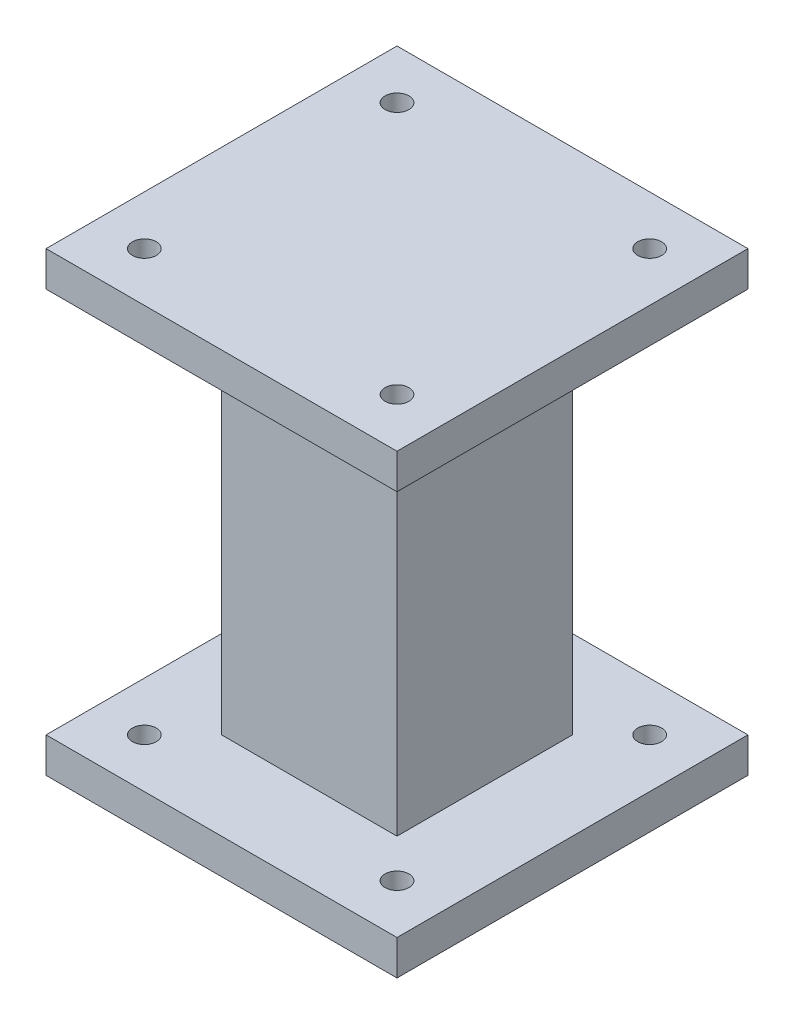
ISO-10303-21;
HEADER;
FILE_DESCRIPTION(('STEP AP214'),'2;1');
FILE_NAME('part.step','',(''),(''),'','','');
FILE_SCHEMA(('AUTOMOTIVE_DESIGN { 1 0 10303 214 1 1 1 1 }'));
ENDSEC;
DATA;
#1=APPLICATION_CONTEXT('core data for automotive mechanical design processes');
#2=APPLICATION_PROTOCOL_DEFINITION('international standard','automotive_design',2000,#1);
#3=PRODUCT_CONTEXT('',#1,'mechanical');
#4=PRODUCT('Part','Part','',(#3));
#5=PRODUCT_RELATED_PRODUCT_CATEGORY('part','',(#4));
#6=PRODUCT_DEFINITION_FORMATION('','',#4);
#7=PRODUCT_DEFINITION_CONTEXT('part definition',#1,'design');
#8=PRODUCT_DEFINITION('design','',#6,#7);
#9=PRODUCT_DEFINITION_SHAPE('','',#8);
#10=(LENGTH_UNIT() NAMED_UNIT(*) SI_UNIT(.MILLI.,.METRE.));
#11=(NAMED_UNIT(*) PLANE_ANGLE_UNIT() SI_UNIT($,.RADIAN.));
#12=(NAMED_UNIT(*) SI_UNIT($,.STERADIAN.) SOLID_ANGLE_UNIT());
#13=UNCERTAINTY_MEASURE_WITH_UNIT(LENGTH_MEASURE(1.E-05),#10,'distance_accuracy_value','');
#14=(GEOMETRIC_REPRESENTATION_CONTEXT(3) GLOBAL_UNCERTAINTY_ASSIGNED_CONTEXT((#13)) GLOBAL_UNIT_ASSIGNED_CONTEXT((#10,
#11,#12)) REPRESENTATION_CONTEXT('',''));
#15=CARTESIAN_POINT('',(0.,0.,0.));
#16=DIRECTION('',(0.,0.,1.));
#17=DIRECTION('',(1.,0.,0.));
#18=AXIS2_PLACEMENT_3D('',#15,#16,#17);
#19=CARTESIAN_POINT('',(-25.,0.,25.));
#20=DIRECTION('',(0.,1.,0.));
#21=DIRECTION('',(0.,0.,1.));
#22=AXIS2_PLACEMENT_3D('',#19,#20,#21);
#23=PLANE('',#22);
#24=DIRECTION('',(0.,0.,1.));
#25=VECTOR('',#24,1.);
#26=CARTESIAN_POINT('',(-25.,0.,25.));
#27=LINE('',#26,#25);
#28=CARTESIAN_POINT('',(-25.,0.,-25.));
#29=VERTEX_POINT('',#28);
#30=CARTESIAN_POINT('',(-25.,0.,25.));
#31=VERTEX_POINT('',#30);
#32=EDGE_CURVE('E249',#29,#31,#27,.T.);
#33=ORIENTED_EDGE('',*,*,#32,.F.);
#34=DIRECTION('',(-1.,0.,0.));
#35=VECTOR('',#34,1.);
#36=CARTESIAN_POINT('',(-25.,0.,-25.));
#37=LINE('',#36,#35);
#38=CARTESIAN_POINT('',(25.,0.,-25.));
#39=VERTEX_POINT('',#38);
#40=EDGE_CURVE('E256',#39,#29,#37,.T.);
#41=ORIENTED_EDGE('',*,*,#40,.F.);
#42=DIRECTION('',(0.,0.,-1.));
#43=VECTOR('',#42,1.);
#44=CARTESIAN_POINT('',(25.,0.,25.));
#45=LINE('',#44,#43);
#46=CARTESIAN_POINT('',(25.,0.,25.));
#47=VERTEX_POINT('',#46);
#48=EDGE_CURVE('E254',#47,#39,#45,.T.);
#49=ORIENTED_EDGE('',*,*,#48,.F.);
#50=DIRECTION('',(1.,0.,0.));
#51=VECTOR('',#50,1.);
#52=CARTESIAN_POINT('',(-25.,0.,25.));
#53=LINE('',#52,#51);
#54=EDGE_CURVE('E252',#31,#47,#53,.T.);
#55=ORIENTED_EDGE('',*,*,#54,.F.);
#56=EDGE_LOOP('',(#33,#41,#49,#55));
#57=FACE_BOUND('',#56,.T.);
#58=DIRECTION('',(0.,0.,1.));
#59=VECTOR('',#58,1.);
#60=CARTESIAN_POINT('',(-20.,0.,-25.));
#61=LINE('',#60,#59);
#62=CARTESIAN_POINT('',(-20.,0.,-20.));
#63=VERTEX_POINT('',#62);
#64=CARTESIAN_POINT('',(-20.,0.,20.));
#65=VERTEX_POINT('',#64);
#66=EDGE_CURVE('E76',#63,#65,#61,.T.);
#67=ORIENTED_EDGE('',*,*,#66,.T.);
#68=DIRECTION('',(1.,0.,0.));
#69=VECTOR('',#68,1.);
#70=CARTESIAN_POINT('',(-25.,0.,20.));
#71=LINE('',#70,#69);
#72=CARTESIAN_POINT('',(20.,0.,20.));
#73=VERTEX_POINT('',#72);
#74=EDGE_CURVE('E220',#65,#73,#71,.T.);
#75=ORIENTED_EDGE('',*,*,#74,.T.);
#76=DIRECTION('',(0.,0.,-1.));
#77=VECTOR('',#76,1.);
#78=CARTESIAN_POINT('',(20.,0.,-25.));
#79=LINE('',#78,#77);
#80=CARTESIAN_POINT('',(20.,0.,-20.));
#81=VERTEX_POINT('',#80);
#82=EDGE_CURVE('E223',#73,#81,#79,.T.);
#83=ORIENTED_EDGE('',*,*,#82,.T.);
#84=DIRECTION('',(-1.,0.,0.));
#85=VECTOR('',#84,1.);
#86=CARTESIAN_POINT('',(-25.,0.,-20.));
#87=LINE('',#86,#85);
#88=EDGE_CURVE('E226',#81,#63,#87,.T.);
#89=ORIENTED_EDGE('',*,*,#88,.T.);
#90=EDGE_LOOP('',(#67,#75,#83,#89));
#91=FACE_BOUND('',#90,.T.);
#92=ADVANCED_FACE('F61',(#57,#91),#23,.F.);
#93=CARTESIAN_POINT('',(-25.,110.,25.));
#94=DIRECTION('',(1.,0.,0.));
#95=DIRECTION('',(0.,0.,-1.));
#96=AXIS2_PLACEMENT_3D('',#93,#94,#95);
#97=PLANE('',#96);
#98=ORIENTED_EDGE('',*,*,#32,.T.);
#99=DIRECTION('',(0.,-1.,0.));
#100=VECTOR('',#99,1.);
#101=CARTESIAN_POINT('',(-25.,110.,25.));
#102=LINE('',#101,#100);
#103=CARTESIAN_POINT('',(-25.,110.,25.));
#104=VERTEX_POINT('',#103);
#105=EDGE_CURVE('E13',#104,#31,#102,.T.);
#106=ORIENTED_EDGE('',*,*,#105,.F.);
#107=DIRECTION('',(0.,0.,1.));
#108=VECTOR('',#107,1.);
#109=CARTESIAN_POINT('',(-25.,110.,25.));
#110=LINE('',#109,#108);
#111=CARTESIAN_POINT('',(-25.,110.,-25.));
#112=VERTEX_POINT('',#111);
#113=EDGE_CURVE('E258',#112,#104,#110,.T.);
#114=ORIENTED_EDGE('',*,*,#113,.F.);
#115=DIRECTION('',(0.,-1.,0.));
#116=VECTOR('',#115,1.);
#117=CARTESIAN_POINT('',(-25.,110.,-25.));
#118=LINE('',#117,#116);
#119=EDGE_CURVE('E270',#112,#29,#118,.T.);
#120=ORIENTED_EDGE('',*,*,#119,.T.);
#121=EDGE_LOOP('',(#98,#106,#114,#120));
#122=FACE_BOUND('',#121,.T.);
#123=ADVANCED_FACE('F63',(#122),#97,.F.);
#124=CARTESIAN_POINT('',(-25.,110.,25.));
#125=DIRECTION('',(0.,0.,-1.));
#126=DIRECTION('',(-1.,0.,0.));
#127=AXIS2_PLACEMENT_3D('',#124,#125,#126);
#128=PLANE('',#127);
#129=ORIENTED_EDGE('',*,*,#54,.T.);
#130=DIRECTION('',(0.,-1.,0.));
#131=VECTOR('',#130,1.);
#132=CARTESIAN_POINT('',(25.,110.,25.));
#133=LINE('',#132,#131);
#134=CARTESIAN_POINT('',(25.,110.,25.));
#135=VERTEX_POINT('',#134);
#136=EDGE_CURVE('E69',#135,#47,#133,.T.);
#137=ORIENTED_EDGE('',*,*,#136,.F.);
#138=DIRECTION('',(1.,0.,0.));
#139=VECTOR('',#138,1.);
#140=CARTESIAN_POINT('',(-25.,110.,25.));
#141=LINE('',#140,#139);
#142=EDGE_CURVE('E261',#104,#135,#141,.T.);
#143=ORIENTED_EDGE('',*,*,#142,.F.);
#144=ORIENTED_EDGE('',*,*,#105,.T.);
#145=EDGE_LOOP('',(#129,#137,#143,#144));
#146=FACE_BOUND('',#145,.T.);
#147=ADVANCED_FACE('F288',(#146),#128,.F.);
#148=CARTESIAN_POINT('',(25.,110.,25.));
#149=DIRECTION('',(-1.,0.,0.));
#150=DIRECTION('',(0.,0.,1.));
#151=AXIS2_PLACEMENT_3D('',#148,#149,#150);
#152=PLANE('',#151);
#153=ORIENTED_EDGE('',*,*,#48,.T.);
#154=DIRECTION('',(0.,-1.,0.));
#155=VECTOR('',#154,1.);
#156=CARTESIAN_POINT('',(25.,110.,-25.));
#157=LINE('',#156,#155);
#158=CARTESIAN_POINT('',(25.,110.,-25.));
#159=VERTEX_POINT('',#158);
#160=EDGE_CURVE('E84',#159,#39,#157,.T.);
#161=ORIENTED_EDGE('',*,*,#160,.F.);
#162=DIRECTION('',(0.,0.,-1.));
#163=VECTOR('',#162,1.);
#164=CARTESIAN_POINT('',(25.,110.,25.));
#165=LINE('',#164,#163);
#166=EDGE_CURVE('E264',#135,#159,#165,.T.);
#167=ORIENTED_EDGE('',*,*,#166,.F.);
#168=ORIENTED_EDGE('',*,*,#136,.T.);
#169=EDGE_LOOP('',(#153,#161,#167,#168));
#170=FACE_BOUND('',#169,.T.);
#171=ADVANCED_FACE('F275',(#170),#152,.F.);
#172=CARTESIAN_POINT('',(-25.,110.,-25.));
#173=DIRECTION('',(0.,0.,1.));
#174=DIRECTION('',(1.,0.,0.));
#175=AXIS2_PLACEMENT_3D('',#172,#173,#174);
#176=PLANE('',#175);
#177=ORIENTED_EDGE('',*,*,#40,.T.);
#178=ORIENTED_EDGE('',*,*,#119,.F.);
#179=DIRECTION('',(-1.,0.,0.));
#180=VECTOR('',#179,1.);
#181=CARTESIAN_POINT('',(-25.,110.,-25.));
#182=LINE('',#181,#180);
#183=EDGE_CURVE('E267',#159,#112,#182,.T.);
#184=ORIENTED_EDGE('',*,*,#183,.F.);
#185=ORIENTED_EDGE('',*,*,#160,.T.);
#186=EDGE_LOOP('',(#177,#178,#184,#185));
#187=FACE_BOUND('',#186,.T.);
#188=ADVANCED_FACE('F283',(#187),#176,.F.);
#189=CARTESIAN_POINT('',(-20.,110.,-25.));
#190=DIRECTION('',(1.,0.,0.));
#191=DIRECTION('',(0.,0.,-1.));
#192=AXIS2_PLACEMENT_3D('',#189,#190,#191);
#193=PLANE('',#192);
#194=ORIENTED_EDGE('',*,*,#66,.F.);
#195=DIRECTION('',(0.,-1.,0.));
#196=VECTOR('',#195,1.);
#197=CARTESIAN_POINT('',(-20.,110.,-20.));
#198=LINE('',#197,#196);
#199=CARTESIAN_POINT('',(-20.,110.,-20.));
#200=VERTEX_POINT('',#199);
#201=EDGE_CURVE('E241',#200,#63,#198,.T.);
#202=ORIENTED_EDGE('',*,*,#201,.F.);
#203=DIRECTION('',(0.,0.,1.));
#204=VECTOR('',#203,1.);
#205=CARTESIAN_POINT('',(-20.,110.,-25.));
#206=LINE('',#205,#204);
#207=CARTESIAN_POINT('',(-20.,110.,20.));
#208=VERTEX_POINT('',#207);
#209=EDGE_CURVE('E229',#200,#208,#206,.T.);
#210=ORIENTED_EDGE('',*,*,#209,.T.);
#211=DIRECTION('',(0.,-1.,0.));
#212=VECTOR('',#211,1.);
#213=CARTESIAN_POINT('',(-20.,110.,20.));
#214=LINE('',#213,#212);
#215=EDGE_CURVE('E247',#208,#65,#214,.T.);
#216=ORIENTED_EDGE('',*,*,#215,.T.);
#217=EDGE_LOOP('',(#194,#202,#210,#216));
#218=FACE_BOUND('',#217,.T.);
#219=ADVANCED_FACE('F301',(#218),#193,.T.);
#220=CARTESIAN_POINT('',(-25.,110.,20.));
#221=DIRECTION('',(0.,0.,-1.));
#222=DIRECTION('',(-1.,0.,0.));
#223=AXIS2_PLACEMENT_3D('',#220,#221,#222);
#224=PLANE('',#223);
#225=ORIENTED_EDGE('',*,*,#74,.F.);
#226=ORIENTED_EDGE('',*,*,#215,.F.);
#227=DIRECTION('',(1.,0.,0.));
#228=VECTOR('',#227,1.);
#229=CARTESIAN_POINT('',(-25.,110.,20.));
#230=LINE('',#229,#228);
#231=CARTESIAN_POINT('',(20.,110.,20.));
#232=VERTEX_POINT('',#231);
#233=EDGE_CURVE('E232',#208,#232,#230,.T.);
#234=ORIENTED_EDGE('',*,*,#233,.T.);
#235=DIRECTION('',(0.,-1.,0.));
#236=VECTOR('',#235,1.);
#237=CARTESIAN_POINT('',(20.,110.,20.));
#238=LINE('',#237,#236);
#239=EDGE_CURVE('E245',#232,#73,#238,.T.);
#240=ORIENTED_EDGE('',*,*,#239,.T.);
#241=EDGE_LOOP('',(#225,#226,#234,#240));
#242=FACE_BOUND('',#241,.T.);
#243=ADVANCED_FACE('F307',(#242),#224,.T.);
#244=CARTESIAN_POINT('',(20.,110.,-25.));
#245=DIRECTION('',(-1.,0.,0.));
#246=DIRECTION('',(0.,0.,1.));
#247=AXIS2_PLACEMENT_3D('',#244,#245,#246);
#248=PLANE('',#247);
#249=ORIENTED_EDGE('',*,*,#82,.F.);
#250=ORIENTED_EDGE('',*,*,#239,.F.);
#251=DIRECTION('',(0.,0.,-1.));
#252=VECTOR('',#251,1.);
#253=CARTESIAN_POINT('',(20.,110.,-25.));
#254=LINE('',#253,#252);
#255=CARTESIAN_POINT('',(20.,110.,-20.));
#256=VERTEX_POINT('',#255);
#257=EDGE_CURVE('E235',#232,#256,#254,.T.);
#258=ORIENTED_EDGE('',*,*,#257,.T.);
#259=DIRECTION('',(0.,-1.,0.));
#260=VECTOR('',#259,1.);
#261=CARTESIAN_POINT('',(20.,110.,-20.));
#262=LINE('',#261,#260);
#263=EDGE_CURVE('E243',#256,#81,#262,.T.);
#264=ORIENTED_EDGE('',*,*,#263,.T.);
#265=EDGE_LOOP('',(#249,#250,#258,#264));
#266=FACE_BOUND('',#265,.T.);
#267=ADVANCED_FACE('F311',(#266),#248,.T.);
#268=CARTESIAN_POINT('',(-25.,110.,-20.));
#269=DIRECTION('',(0.,0.,1.));
#270=DIRECTION('',(1.,0.,0.));
#271=AXIS2_PLACEMENT_3D('',#268,#269,#270);
#272=PLANE('',#271);
#273=ORIENTED_EDGE('',*,*,#88,.F.);
#274=ORIENTED_EDGE('',*,*,#263,.F.);
#275=DIRECTION('',(-1.,0.,0.));
#276=VECTOR('',#275,1.);
#277=CARTESIAN_POINT('',(-25.,110.,-20.));
#278=LINE('',#277,#276);
#279=EDGE_CURVE('E238',#256,#200,#278,.T.);
#280=ORIENTED_EDGE('',*,*,#279,.T.);
#281=ORIENTED_EDGE('',*,*,#201,.T.);
#282=EDGE_LOOP('',(#273,#274,#280,#281));
#283=FACE_BOUND('',#282,.T.);
#284=ADVANCED_FACE('F316',(#283),#272,.T.);
#285=CARTESIAN_POINT('',(-50.,110.,-50.));
#286=DIRECTION('',(0.,-1.,0.));
#287=DIRECTION('',(0.,0.,-1.));
#288=AXIS2_PLACEMENT_3D('',#285,#286,#287);
#289=PLANE('',#288);
#290=ORIENTED_EDGE('',*,*,#233,.F.);
#291=ORIENTED_EDGE('',*,*,#209,.F.);
#292=ORIENTED_EDGE('',*,*,#279,.F.);
#293=ORIENTED_EDGE('',*,*,#257,.F.);
#294=EDGE_LOOP('',(#290,#291,#292,#293));
#295=FACE_BOUND('',#294,.T.);
#296=ADVANCED_FACE('F322',(#295),#289,.T.);
#297=CARTESIAN_POINT('',(36.,110.,-36.));
#298=DIRECTION('',(0.,-1.,0.));
#299=DIRECTION('',(0.,0.,-1.));
#300=AXIS2_PLACEMENT_3D('',#297,#298,#299);
#301=CIRCLE('',#300,3.39999999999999);
#302=CARTESIAN_POINT('',(36.,110.,-39.4));
#303=VERTEX_POINT('',#302);
#304=EDGE_CURVE('E195',#303,#303,#301,.T.);
#305=ORIENTED_EDGE('',*,*,#304,.F.);
#306=EDGE_LOOP('',(#305));
#307=FACE_BOUND('',#306,.T.);
#308=CARTESIAN_POINT('',(-36.,110.,-36.));
#309=DIRECTION('',(0.,-1.,0.));
#310=DIRECTION('',(0.,0.,-1.));
#311=AXIS2_PLACEMENT_3D('',#308,#309,#310);
#312=CIRCLE('',#311,3.39999999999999);
#313=CARTESIAN_POINT('',(-36.,110.,-39.4));
#314=VERTEX_POINT('',#313);
#315=EDGE_CURVE('E198',#314,#314,#312,.T.);
#316=ORIENTED_EDGE('',*,*,#315,.F.);
#317=EDGE_LOOP('',(#316));
#318=FACE_BOUND('',#317,.T.);
#319=CARTESIAN_POINT('',(36.,110.,36.));
#320=DIRECTION('',(0.,-1.,0.));
#321=DIRECTION('',(0.,0.,-1.));
#322=AXIS2_PLACEMENT_3D('',#319,#320,#321);
#323=CIRCLE('',#322,3.39999999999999);
#324=CARTESIAN_POINT('',(36.,110.,32.6));
#325=VERTEX_POINT('',#324);
#326=EDGE_CURVE('E201',#325,#325,#323,.T.);
#327=ORIENTED_EDGE('',*,*,#326,.F.);
#328=EDGE_LOOP('',(#327));
#329=FACE_BOUND('',#328,.T.);
#330=CARTESIAN_POINT('',(-36.,110.,36.));
#331=DIRECTION('',(0.,-1.,0.));
#332=DIRECTION('',(0.,0.,-1.));
#333=AXIS2_PLACEMENT_3D('',#330,#331,#332);
#334=CIRCLE('',#333,3.39999999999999);
#335=CARTESIAN_POINT('',(-36.,110.,32.6));
#336=VERTEX_POINT('',#335);
#337=EDGE_CURVE('E204',#336,#336,#334,.T.);
#338=ORIENTED_EDGE('',*,*,#337,.F.);
#339=EDGE_LOOP('',(#338));
#340=FACE_BOUND('',#339,.T.);
#341=DIRECTION('',(0.,0.,1.));
#342=VECTOR('',#341,1.);
#343=CARTESIAN_POINT('',(-50.,110.,50.));
#344=LINE('',#343,#342);
#345=CARTESIAN_POINT('',(-50.,110.,-50.));
#346=VERTEX_POINT('',#345);
#347=CARTESIAN_POINT('',(-50.,110.,50.));
#348=VERTEX_POINT('',#347);
#349=EDGE_CURVE('E171',#346,#348,#344,.T.);
#350=ORIENTED_EDGE('',*,*,#349,.F.);
#351=DIRECTION('',(-1.,0.,0.));
#352=VECTOR('',#351,1.);
#353=CARTESIAN_POINT('',(-50.,110.,-50.));
#354=LINE('',#353,#352);
#355=CARTESIAN_POINT('',(50.,110.,-50.));
#356=VERTEX_POINT('',#355);
#357=EDGE_CURVE('E170',#356,#346,#354,.T.);
#358=ORIENTED_EDGE('',*,*,#357,.F.);
#359=DIRECTION('',(0.,0.,-1.));
#360=VECTOR('',#359,1.);
#361=CARTESIAN_POINT('',(50.,110.,50.));
#362=LINE('',#361,#360);
#363=CARTESIAN_POINT('',(50.,110.,50.));
#364=VERTEX_POINT('',#363);
#365=EDGE_CURVE('E187',#364,#356,#362,.T.);
#366=ORIENTED_EDGE('',*,*,#365,.F.);
#367=DIRECTION('',(1.,0.,0.));
#368=VECTOR('',#367,1.);
#369=CARTESIAN_POINT('',(-50.,110.,50.));
#370=LINE('',#369,#368);
#371=EDGE_CURVE('E192',#348,#364,#370,.T.);
#372=ORIENTED_EDGE('',*,*,#371,.F.);
#373=EDGE_LOOP('',(#350,#358,#366,#372));
#374=FACE_BOUND('',#373,.T.);
#375=ORIENTED_EDGE('',*,*,#113,.T.);
#376=ORIENTED_EDGE('',*,*,#142,.T.);
#377=ORIENTED_EDGE('',*,*,#166,.T.);
#378=ORIENTED_EDGE('',*,*,#183,.T.);
#379=EDGE_LOOP('',(#375,#376,#377,#378));
#380=FACE_BOUND('',#379,.T.);
#381=ADVANCED_FACE('F287',(#307,#318,#329,#340,#374,#380),#289,.T.);
#382=CARTESIAN_POINT('',(-50.,110.,50.));
#383=DIRECTION('',(-1.,0.,0.));
#384=DIRECTION('',(0.,0.,1.));
#385=AXIS2_PLACEMENT_3D('',#382,#383,#384);
#386=PLANE('',#385);
#387=DIRECTION('',(0.,0.,1.));
#388=VECTOR('',#387,1.);
#389=CARTESIAN_POINT('',(-50.,120.,50.));
#390=LINE('',#389,#388);
#391=CARTESIAN_POINT('',(-50.,120.,-50.));
#392=VERTEX_POINT('',#391);
#393=CARTESIAN_POINT('',(-50.,120.,50.));
#394=VERTEX_POINT('',#393);
#395=EDGE_CURVE('E152',#392,#394,#390,.T.);
#396=ORIENTED_EDGE('',*,*,#395,.F.);
#397=DIRECTION('',(0.,1.,0.));
#398=VECTOR('',#397,1.);
#399=CARTESIAN_POINT('',(-50.,110.,-50.));
#400=LINE('',#399,#398);
#401=EDGE_CURVE('E155',#346,#392,#400,.T.);
#402=ORIENTED_EDGE('',*,*,#401,.F.);
#403=ORIENTED_EDGE('',*,*,#349,.T.);
#404=DIRECTION('',(0.,1.,0.));
#405=VECTOR('',#404,1.);
#406=CARTESIAN_POINT('',(-50.,110.,50.));
#407=LINE('',#406,#405);
#408=EDGE_CURVE('E158',#348,#394,#407,.T.);
#409=ORIENTED_EDGE('',*,*,#408,.T.);
#410=EDGE_LOOP('',(#396,#402,#403,#409));
#411=FACE_BOUND('',#410,.T.);
#412=ADVANCED_FACE('F154',(#411),#386,.T.);
#413=CARTESIAN_POINT('',(-50.,110.,-50.));
#414=DIRECTION('',(0.,0.,-1.));
#415=DIRECTION('',(-1.,0.,0.));
#416=AXIS2_PLACEMENT_3D('',#413,#414,#415);
#417=PLANE('',#416);
#418=DIRECTION('',(-1.,0.,0.));
#419=VECTOR('',#418,1.);
#420=CARTESIAN_POINT('',(-50.,120.,-50.));
#421=LINE('',#420,#419);
#422=CARTESIAN_POINT('',(50.,120.,-50.));
#423=VERTEX_POINT('',#422);
#424=EDGE_CURVE('E167',#423,#392,#421,.T.);
#425=ORIENTED_EDGE('',*,*,#424,.F.);
#426=DIRECTION('',(0.,1.,0.));
#427=VECTOR('',#426,1.);
#428=CARTESIAN_POINT('',(50.,110.,-50.));
#429=LINE('',#428,#427);
#430=EDGE_CURVE('E176',#356,#423,#429,.T.);
#431=ORIENTED_EDGE('',*,*,#430,.F.);
#432=ORIENTED_EDGE('',*,*,#357,.T.);
#433=ORIENTED_EDGE('',*,*,#401,.T.);
#434=EDGE_LOOP('',(#425,#431,#432,#433));
#435=FACE_BOUND('',#434,.T.);
#436=ADVANCED_FACE('F166',(#435),#417,.T.);
#437=CARTESIAN_POINT('',(50.,110.,50.));
#438=DIRECTION('',(1.,0.,0.));
#439=DIRECTION('',(0.,0.,-1.));
#440=AXIS2_PLACEMENT_3D('',#437,#438,#439);
#441=PLANE('',#440);
#442=DIRECTION('',(0.,0.,-1.));
#443=VECTOR('',#442,1.);
#444=CARTESIAN_POINT('',(50.,120.,50.));
#445=LINE('',#444,#443);
#446=CARTESIAN_POINT('',(50.,120.,50.));
#447=VERTEX_POINT('',#446);
#448=EDGE_CURVE('E175',#447,#423,#445,.T.);
#449=ORIENTED_EDGE('',*,*,#448,.F.);
#450=DIRECTION('',(0.,1.,0.));
#451=VECTOR('',#450,1.);
#452=CARTESIAN_POINT('',(50.,110.,50.));
#453=LINE('',#452,#451);
#454=EDGE_CURVE('E184',#364,#447,#453,.T.);
#455=ORIENTED_EDGE('',*,*,#454,.F.);
#456=ORIENTED_EDGE('',*,*,#365,.T.);
#457=ORIENTED_EDGE('',*,*,#430,.T.);
#458=EDGE_LOOP('',(#449,#455,#456,#457));
#459=FACE_BOUND('',#458,.T.);
#460=ADVANCED_FACE('F349',(#459),#441,.T.);
#461=CARTESIAN_POINT('',(-50.,110.,50.));
#462=DIRECTION('',(0.,0.,1.));
#463=DIRECTION('',(1.,0.,0.));
#464=AXIS2_PLACEMENT_3D('',#461,#462,#463);
#465=PLANE('',#464);
#466=DIRECTION('',(1.,0.,0.));
#467=VECTOR('',#466,1.);
#468=CARTESIAN_POINT('',(-50.,120.,50.));
#469=LINE('',#468,#467);
#470=EDGE_CURVE('E190',#394,#447,#469,.T.);
#471=ORIENTED_EDGE('',*,*,#470,.F.);
#472=ORIENTED_EDGE('',*,*,#408,.F.);
#473=ORIENTED_EDGE('',*,*,#371,.T.);
#474=ORIENTED_EDGE('',*,*,#454,.T.);
#475=EDGE_LOOP('',(#471,#472,#473,#474));
#476=FACE_BOUND('',#475,.T.);
#477=ADVANCED_FACE('F342',(#476),#465,.T.);
#478=CARTESIAN_POINT('',(-50.,120.,-50.));
#479=DIRECTION('',(0.,-1.,0.));
#480=DIRECTION('',(0.,0.,-1.));
#481=AXIS2_PLACEMENT_3D('',#478,#479,#480);
#482=PLANE('',#481);
#483=CARTESIAN_POINT('',(36.,120.,-36.));
#484=DIRECTION('',(0.,-1.,0.));
#485=DIRECTION('',(0.,0.,-1.));
#486=AXIS2_PLACEMENT_3D('',#483,#484,#485);
#487=CIRCLE('',#486,3.39999999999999);
#488=CARTESIAN_POINT('',(36.,120.,-39.4));
#489=VERTEX_POINT('',#488);
#490=EDGE_CURVE('E207',#489,#489,#487,.T.);
#491=ORIENTED_EDGE('',*,*,#490,.T.);
#492=EDGE_LOOP('',(#491));
#493=FACE_BOUND('',#492,.T.);
#494=CARTESIAN_POINT('',(-36.,120.,-36.));
#495=DIRECTION('',(0.,-1.,0.));
#496=DIRECTION('',(0.,0.,-1.));
#497=AXIS2_PLACEMENT_3D('',#494,#495,#496);
#498=CIRCLE('',#497,3.39999999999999);
#499=CARTESIAN_POINT('',(-36.,120.,-39.4));
#500=VERTEX_POINT('',#499);
#501=EDGE_CURVE('E210',#500,#500,#498,.T.);
#502=ORIENTED_EDGE('',*,*,#501,.T.);
#503=EDGE_LOOP('',(#502));
#504=FACE_BOUND('',#503,.T.);
#505=CARTESIAN_POINT('',(36.,120.,36.));
#506=DIRECTION('',(0.,-1.,0.));
#507=DIRECTION('',(0.,0.,-1.));
#508=AXIS2_PLACEMENT_3D('',#505,#506,#507);
#509=CIRCLE('',#508,3.39999999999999);
#510=CARTESIAN_POINT('',(36.,120.,32.6));
#511=VERTEX_POINT('',#510);
#512=EDGE_CURVE('E213',#511,#511,#509,.T.);
#513=ORIENTED_EDGE('',*,*,#512,.T.);
#514=EDGE_LOOP('',(#513));
#515=FACE_BOUND('',#514,.T.);
#516=CARTESIAN_POINT('',(-36.,120.,36.));
#517=DIRECTION('',(0.,-1.,0.));
#518=DIRECTION('',(0.,0.,-1.));
#519=AXIS2_PLACEMENT_3D('',#516,#517,#518);
#520=CIRCLE('',#519,3.39999999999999);
#521=CARTESIAN_POINT('',(-36.,120.,32.6));
#522=VERTEX_POINT('',#521);
#523=EDGE_CURVE('E216',#522,#522,#520,.T.);
#524=ORIENTED_EDGE('',*,*,#523,.T.);
#525=EDGE_LOOP('',(#524));
#526=FACE_BOUND('',#525,.T.);
#527=ORIENTED_EDGE('',*,*,#395,.T.);
#528=ORIENTED_EDGE('',*,*,#470,.T.);
#529=ORIENTED_EDGE('',*,*,#448,.T.);
#530=ORIENTED_EDGE('',*,*,#424,.T.);
#531=EDGE_LOOP('',(#527,#528,#529,#530));
#532=FACE_BOUND('',#531,.T.);
#533=ADVANCED_FACE('F174',(#493,#504,#515,#526,#532),#482,.F.);
#534=CARTESIAN_POINT('',(-36.,110.,36.));
#535=DIRECTION('',(0.,-1.,0.));
#536=DIRECTION('',(0.,0.,-1.));
#537=AXIS2_PLACEMENT_3D('',#534,#535,#536);
#538=CYLINDRICAL_SURFACE('',#537,3.39999999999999);
#539=ORIENTED_EDGE('',*,*,#337,.T.);
#540=EDGE_LOOP('',(#539));
#541=FACE_BOUND('',#540,.T.);
#542=ORIENTED_EDGE('',*,*,#523,.F.);
#543=EDGE_LOOP('',(#542));
#544=FACE_BOUND('',#543,.T.);
#545=ADVANCED_FACE('F335',(#541,#544),#538,.F.);
#546=CARTESIAN_POINT('',(36.,110.,36.));
#547=DIRECTION('',(0.,-1.,0.));
#548=DIRECTION('',(0.,0.,-1.));
#549=AXIS2_PLACEMENT_3D('',#546,#547,#548);
#550=CYLINDRICAL_SURFACE('',#549,3.39999999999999);
#551=ORIENTED_EDGE('',*,*,#326,.T.);
#552=EDGE_LOOP('',(#551));
#553=FACE_BOUND('',#552,.T.);
#554=ORIENTED_EDGE('',*,*,#512,.F.);
#555=EDGE_LOOP('',(#554));
#556=FACE_BOUND('',#555,.T.);
#557=ADVANCED_FACE('F331',(#553,#556),#550,.F.);
#558=CARTESIAN_POINT('',(-36.,110.,-36.));
#559=DIRECTION('',(0.,-1.,0.));
#560=DIRECTION('',(0.,0.,-1.));
#561=AXIS2_PLACEMENT_3D('',#558,#559,#560);
#562=CYLINDRICAL_SURFACE('',#561,3.39999999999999);
#563=ORIENTED_EDGE('',*,*,#315,.T.);
#564=EDGE_LOOP('',(#563));
#565=FACE_BOUND('',#564,.T.);
#566=ORIENTED_EDGE('',*,*,#501,.F.);
#567=EDGE_LOOP('',(#566));
#568=FACE_BOUND('',#567,.T.);
#569=ADVANCED_FACE('F327',(#565,#568),#562,.F.);
#570=CARTESIAN_POINT('',(36.,110.,-36.));
#571=DIRECTION('',(0.,-1.,0.));
#572=DIRECTION('',(0.,0.,-1.));
#573=AXIS2_PLACEMENT_3D('',#570,#571,#572);
#574=CYLINDRICAL_SURFACE('',#573,3.39999999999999);
#575=ORIENTED_EDGE('',*,*,#304,.T.);
#576=EDGE_LOOP('',(#575));
#577=FACE_BOUND('',#576,.T.);
#578=ORIENTED_EDGE('',*,*,#490,.F.);
#579=EDGE_LOOP('',(#578));
#580=FACE_BOUND('',#579,.T.);
#581=ADVANCED_FACE('F324',(#577,#580),#574,.F.);
#582=CLOSED_SHELL('',(#92,#123,#147,#171,#188,#219,#243,#267,#284,#296,#381,#412,#436,#460,#477,
#533,#545,#557,#569,#581));
#583=MANIFOLD_SOLID_BREP('B2',#582);
#584=CARTESIAN_POINT('',(-50.,-10.,50.));
#585=DIRECTION('',(-1.,0.,0.));
#586=DIRECTION('',(0.,0.,1.));
#587=AXIS2_PLACEMENT_3D('',#584,#585,#586);
#588=PLANE('',#587);
#589=DIRECTION('',(0.,0.,1.));
#590=VECTOR('',#589,1.);
#591=CARTESIAN_POINT('',(-50.,0.,50.));
#592=LINE('',#591,#590);
#593=CARTESIAN_POINT('',(-50.,0.,-50.));
#594=VERTEX_POINT('',#593);
#595=CARTESIAN_POINT('',(-50.,0.,50.));
#596=VERTEX_POINT('',#595);
#597=EDGE_CURVE('E497',#594,#596,#592,.T.);
#598=ORIENTED_EDGE('',*,*,#597,.F.);
#599=DIRECTION('',(0.,1.,0.));
#600=VECTOR('',#599,1.);
#601=CARTESIAN_POINT('',(-50.,-10.,-50.));
#602=LINE('',#601,#600);
#603=CARTESIAN_POINT('',(-50.,-10.,-50.));
#604=VERTEX_POINT('',#603);
#605=EDGE_CURVE('E59',#604,#594,#602,.T.);
#606=ORIENTED_EDGE('',*,*,#605,.F.);
#607=DIRECTION('',(0.,0.,1.));
#608=VECTOR('',#607,1.);
#609=CARTESIAN_POINT('',(-50.,-10.,50.));
#610=LINE('',#609,#608);
#611=CARTESIAN_POINT('',(-50.,-10.,50.));
#612=VERTEX_POINT('',#611);
#613=EDGE_CURVE('E499',#604,#612,#610,.T.);
#614=ORIENTED_EDGE('',*,*,#613,.T.);
#615=DIRECTION('',(0.,1.,0.));
#616=VECTOR('',#615,1.);
#617=CARTESIAN_POINT('',(-50.,-10.,50.));
#618=LINE('',#617,#616);
#619=EDGE_CURVE('E460',#612,#596,#618,.T.);
#620=ORIENTED_EDGE('',*,*,#619,.T.);
#621=EDGE_LOOP('',(#598,#606,#614,#620));
#622=FACE_BOUND('',#621,.T.);
#623=ADVANCED_FACE('F457',(#622),#588,.T.);
#624=CARTESIAN_POINT('',(-50.,-10.,-50.));
#625=DIRECTION('',(0.,0.,-1.));
#626=DIRECTION('',(-1.,0.,0.));
#627=AXIS2_PLACEMENT_3D('',#624,#625,#626);
#628=PLANE('',#627);
#629=DIRECTION('',(-1.,0.,0.));
#630=VECTOR('',#629,1.);
#631=CARTESIAN_POINT('',(-50.,0.,-50.));
#632=LINE('',#631,#630);
#633=CARTESIAN_POINT('',(50.,0.,-50.));
#634=VERTEX_POINT('',#633);
#635=EDGE_CURVE('E514',#634,#594,#632,.T.);
#636=ORIENTED_EDGE('',*,*,#635,.F.);
#637=DIRECTION('',(0.,1.,0.));
#638=VECTOR('',#637,1.);
#639=CARTESIAN_POINT('',(50.,-10.,-50.));
#640=LINE('',#639,#638);
#641=CARTESIAN_POINT('',(50.,-10.,-50.));
#642=VERTEX_POINT('',#641);
#643=EDGE_CURVE('E465',#642,#634,#640,.T.);
#644=ORIENTED_EDGE('',*,*,#643,.F.);
#645=DIRECTION('',(-1.,0.,0.));
#646=VECTOR('',#645,1.);
#647=CARTESIAN_POINT('',(-50.,-10.,-50.));
#648=LINE('',#647,#646);
#649=EDGE_CURVE('E504',#642,#604,#648,.T.);
#650=ORIENTED_EDGE('',*,*,#649,.T.);
#651=ORIENTED_EDGE('',*,*,#605,.T.);
#652=EDGE_LOOP('',(#636,#644,#650,#651));
#653=FACE_BOUND('',#652,.T.);
#654=ADVANCED_FACE('F534',(#653),#628,.T.);
#655=CARTESIAN_POINT('',(50.,-10.,50.));
#656=DIRECTION('',(1.,0.,0.));
#657=DIRECTION('',(0.,0.,-1.));
#658=AXIS2_PLACEMENT_3D('',#655,#656,#657);
#659=PLANE('',#658);
#660=DIRECTION('',(0.,0.,-1.));
#661=VECTOR('',#660,1.);
#662=CARTESIAN_POINT('',(50.,0.,50.));
#663=LINE('',#662,#661);
#664=CARTESIAN_POINT('',(50.,0.,50.));
#665=VERTEX_POINT('',#664);
#666=EDGE_CURVE('E511',#665,#634,#663,.T.);
#667=ORIENTED_EDGE('',*,*,#666,.F.);
#668=DIRECTION('',(0.,1.,0.));
#669=VECTOR('',#668,1.);
#670=CARTESIAN_POINT('',(50.,-10.,50.));
#671=LINE('',#670,#669);
#672=CARTESIAN_POINT('',(50.,-10.,50.));
#673=VERTEX_POINT('',#672);
#674=EDGE_CURVE('E503',#673,#665,#671,.T.);
#675=ORIENTED_EDGE('',*,*,#674,.F.);
#676=DIRECTION('',(0.,0.,-1.));
#677=VECTOR('',#676,1.);
#678=CARTESIAN_POINT('',(50.,-10.,50.));
#679=LINE('',#678,#677);
#680=EDGE_CURVE('E527',#673,#642,#679,.T.);
#681=ORIENTED_EDGE('',*,*,#680,.T.);
#682=ORIENTED_EDGE('',*,*,#643,.T.);
#683=EDGE_LOOP('',(#667,#675,#681,#682));
#684=FACE_BOUND('',#683,.T.);
#685=ADVANCED_FACE('F531',(#684),#659,.T.);
#686=CARTESIAN_POINT('',(-50.,-10.,50.));
#687=DIRECTION('',(0.,0.,1.));
#688=DIRECTION('',(1.,0.,0.));
#689=AXIS2_PLACEMENT_3D('',#686,#687,#688);
#690=PLANE('',#689);
#691=DIRECTION('',(1.,0.,0.));
#692=VECTOR('',#691,1.);
#693=CARTESIAN_POINT('',(-50.,0.,50.));
#694=LINE('',#693,#692);
#695=EDGE_CURVE('E506',#596,#665,#694,.T.);
#696=ORIENTED_EDGE('',*,*,#695,.F.);
#697=ORIENTED_EDGE('',*,*,#619,.F.);
#698=DIRECTION('',(1.,0.,0.));
#699=VECTOR('',#698,1.);
#700=CARTESIAN_POINT('',(-50.,-10.,50.));
#701=LINE('',#700,#699);
#702=EDGE_CURVE('E525',#612,#673,#701,.T.);
#703=ORIENTED_EDGE('',*,*,#702,.T.);
#704=ORIENTED_EDGE('',*,*,#674,.T.);
#705=EDGE_LOOP('',(#696,#697,#703,#704));
#706=FACE_BOUND('',#705,.T.);
#707=ADVANCED_FACE('F507',(#706),#690,.T.);
#708=CARTESIAN_POINT('',(-50.,-10.,-50.));
#709=DIRECTION('',(0.,-1.,0.));
#710=DIRECTION('',(0.,0.,-1.));
#711=AXIS2_PLACEMENT_3D('',#708,#709,#710);
#712=PLANE('',#711);
#713=CARTESIAN_POINT('',(36.,-10.,-36.));
#714=DIRECTION('',(0.,-1.,0.));
#715=DIRECTION('',(0.,0.,-1.));
#716=AXIS2_PLACEMENT_3D('',#713,#714,#715);
#717=CIRCLE('',#716,3.39999999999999);
#718=CARTESIAN_POINT('',(36.,-10.,-39.4));
#719=VERTEX_POINT('',#718);
#720=EDGE_CURVE('E602',#719,#719,#717,.T.);
#721=ORIENTED_EDGE('',*,*,#720,.F.);
#722=EDGE_LOOP('',(#721));
#723=FACE_BOUND('',#722,.T.);
#724=CARTESIAN_POINT('',(-36.,-10.,-36.));
#725=DIRECTION('',(0.,-1.,0.));
#726=DIRECTION('',(0.,0.,-1.));
#727=AXIS2_PLACEMENT_3D('',#724,#725,#726);
#728=CIRCLE('',#727,3.39999999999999);
#729=CARTESIAN_POINT('',(-36.,-10.,-39.4));
#730=VERTEX_POINT('',#729);
#731=EDGE_CURVE('E606',#730,#730,#728,.T.);
#732=ORIENTED_EDGE('',*,*,#731,.F.);
#733=EDGE_LOOP('',(#732));
#734=FACE_BOUND('',#733,.T.);
#735=CARTESIAN_POINT('',(36.,-10.,36.));
#736=DIRECTION('',(0.,-1.,0.));
#737=DIRECTION('',(0.,0.,-1.));
#738=AXIS2_PLACEMENT_3D('',#735,#736,#737);
#739=CIRCLE('',#738,3.39999999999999);
#740=CARTESIAN_POINT('',(36.,-10.,32.6));
#741=VERTEX_POINT('',#740);
#742=EDGE_CURVE('E615',#741,#741,#739,.T.);
#743=ORIENTED_EDGE('',*,*,#742,.F.);
#744=EDGE_LOOP('',(#743));
#745=FACE_BOUND('',#744,.T.);
#746=CARTESIAN_POINT('',(-36.,-10.,36.));
#747=DIRECTION('',(0.,-1.,0.));
#748=DIRECTION('',(0.,0.,-1.));
#749=AXIS2_PLACEMENT_3D('',#746,#747,#748);
#750=CIRCLE('',#749,3.39999999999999);
#751=CARTESIAN_POINT('',(-36.,-10.,32.6));
#752=VERTEX_POINT('',#751);
#753=EDGE_CURVE('E518',#752,#752,#750,.T.);
#754=ORIENTED_EDGE('',*,*,#753,.F.);
#755=EDGE_LOOP('',(#754));
#756=FACE_BOUND('',#755,.T.);
#757=ORIENTED_EDGE('',*,*,#613,.F.);
#758=ORIENTED_EDGE('',*,*,#649,.F.);
#759=ORIENTED_EDGE('',*,*,#680,.F.);
#760=ORIENTED_EDGE('',*,*,#702,.F.);
#761=EDGE_LOOP('',(#757,#758,#759,#760));
#762=FACE_BOUND('',#761,.T.);
#763=ADVANCED_FACE('F536',(#723,#734,#745,#756,#762),#712,.T.);
#764=CARTESIAN_POINT('',(-50.,0.,-50.));
#765=DIRECTION('',(0.,-1.,0.));
#766=DIRECTION('',(0.,0.,-1.));
#767=AXIS2_PLACEMENT_3D('',#764,#765,#766);
#768=PLANE('',#767);
#769=CARTESIAN_POINT('',(36.,0.,-36.));
#770=DIRECTION('',(0.,-1.,0.));
#771=DIRECTION('',(0.,0.,-1.));
#772=AXIS2_PLACEMENT_3D('',#769,#770,#771);
#773=CIRCLE('',#772,3.39999999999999);
#774=CARTESIAN_POINT('',(36.,0.,-39.4));
#775=VERTEX_POINT('',#774);
#776=EDGE_CURVE('E605',#775,#775,#773,.T.);
#777=ORIENTED_EDGE('',*,*,#776,.T.);
#778=EDGE_LOOP('',(#777));
#779=FACE_BOUND('',#778,.T.);
#780=CARTESIAN_POINT('',(-36.,0.,-36.));
#781=DIRECTION('',(0.,-1.,0.));
#782=DIRECTION('',(0.,0.,-1.));
#783=AXIS2_PLACEMENT_3D('',#780,#781,#782);
#784=CIRCLE('',#783,3.39999999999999);
#785=CARTESIAN_POINT('',(-36.,0.,-39.4));
#786=VERTEX_POINT('',#785);
#787=EDGE_CURVE('E609',#786,#786,#784,.T.);
#788=ORIENTED_EDGE('',*,*,#787,.T.);
#789=EDGE_LOOP('',(#788));
#790=FACE_BOUND('',#789,.T.);
#791=CARTESIAN_POINT('',(36.,0.,36.));
#792=DIRECTION('',(0.,-1.,0.));
#793=DIRECTION('',(0.,0.,-1.));
#794=AXIS2_PLACEMENT_3D('',#791,#792,#793);
#795=CIRCLE('',#794,3.39999999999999);
#796=CARTESIAN_POINT('',(36.,0.,32.6));
#797=VERTEX_POINT('',#796);
#798=EDGE_CURVE('E618',#797,#797,#795,.T.);
#799=ORIENTED_EDGE('',*,*,#798,.T.);
#800=EDGE_LOOP('',(#799));
#801=FACE_BOUND('',#800,.T.);
#802=CARTESIAN_POINT('',(-36.,0.,36.));
#803=DIRECTION('',(0.,-1.,0.));
#804=DIRECTION('',(0.,0.,-1.));
#805=AXIS2_PLACEMENT_3D('',#802,#803,#804);
#806=CIRCLE('',#805,3.39999999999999);
#807=CARTESIAN_POINT('',(-36.,0.,32.6));
#808=VERTEX_POINT('',#807);
#809=EDGE_CURVE('E515',#808,#808,#806,.T.);
#810=ORIENTED_EDGE('',*,*,#809,.T.);
#811=EDGE_LOOP('',(#810));
#812=FACE_BOUND('',#811,.T.);
#813=ORIENTED_EDGE('',*,*,#597,.T.);
#814=ORIENTED_EDGE('',*,*,#695,.T.);
#815=ORIENTED_EDGE('',*,*,#666,.T.);
#816=ORIENTED_EDGE('',*,*,#635,.T.);
#817=EDGE_LOOP('',(#813,#814,#815,#816));
#818=FACE_BOUND('',#817,.T.);
#819=ADVANCED_FACE('F513',(#779,#790,#801,#812,#818),#768,.F.);
#820=CARTESIAN_POINT('',(-36.,-10.,36.));
#821=DIRECTION('',(0.,-1.,0.));
#822=DIRECTION('',(0.,0.,-1.));
#823=AXIS2_PLACEMENT_3D('',#820,#821,#822);
#824=CYLINDRICAL_SURFACE('',#823,3.39999999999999);
#825=ORIENTED_EDGE('',*,*,#753,.T.);
#826=EDGE_LOOP('',(#825));
#827=FACE_BOUND('',#826,.T.);
#828=ORIENTED_EDGE('',*,*,#809,.F.);
#829=EDGE_LOOP('',(#828));
#830=FACE_BOUND('',#829,.T.);
#831=ADVANCED_FACE('F544',(#827,#830),#824,.F.);
#832=CARTESIAN_POINT('',(36.,-10.,36.));
#833=DIRECTION('',(0.,-1.,0.));
#834=DIRECTION('',(0.,0.,-1.));
#835=AXIS2_PLACEMENT_3D('',#832,#833,#834);
#836=CYLINDRICAL_SURFACE('',#835,3.39999999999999);
#837=ORIENTED_EDGE('',*,*,#742,.T.);
#838=EDGE_LOOP('',(#837));
#839=FACE_BOUND('',#838,.T.);
#840=ORIENTED_EDGE('',*,*,#798,.F.);
#841=EDGE_LOOP('',(#840));
#842=FACE_BOUND('',#841,.T.);
#843=ADVANCED_FACE('F569',(#839,#842),#836,.F.);
#844=CARTESIAN_POINT('',(-36.,-10.,-36.));
#845=DIRECTION('',(0.,-1.,0.));
#846=DIRECTION('',(0.,0.,-1.));
#847=AXIS2_PLACEMENT_3D('',#844,#845,#846);
#848=CYLINDRICAL_SURFACE('',#847,3.39999999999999);
#849=ORIENTED_EDGE('',*,*,#731,.T.);
#850=EDGE_LOOP('',(#849));
#851=FACE_BOUND('',#850,.T.);
#852=ORIENTED_EDGE('',*,*,#787,.F.);
#853=EDGE_LOOP('',(#852));
#854=FACE_BOUND('',#853,.T.);
#855=ADVANCED_FACE('F582',(#851,#854),#848,.F.);
#856=CARTESIAN_POINT('',(36.,-10.,-36.));
#857=DIRECTION('',(0.,-1.,0.));
#858=DIRECTION('',(0.,0.,-1.));
#859=AXIS2_PLACEMENT_3D('',#856,#857,#858);
#860=CYLINDRICAL_SURFACE('',#859,3.39999999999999);
#861=ORIENTED_EDGE('',*,*,#720,.T.);
#862=EDGE_LOOP('',(#861));
#863=FACE_BOUND('',#862,.T.);
#864=ORIENTED_EDGE('',*,*,#776,.F.);
#865=EDGE_LOOP('',(#864));
#866=FACE_BOUND('',#865,.T.);
#867=ADVANCED_FACE('F590',(#863,#866),#860,.F.);
#868=CLOSED_SHELL('',(#623,#654,#685,#707,#763,#819,#831,#843,#855,#867));
#869=MANIFOLD_SOLID_BREP('B7',#868);
#870=ADVANCED_BREP_SHAPE_REPRESENTATION('',(#18,#583,#869),#14);
#871=SHAPE_DEFINITION_REPRESENTATION(#9,#870);
ENDSEC;
END-ISO-10303-21;
